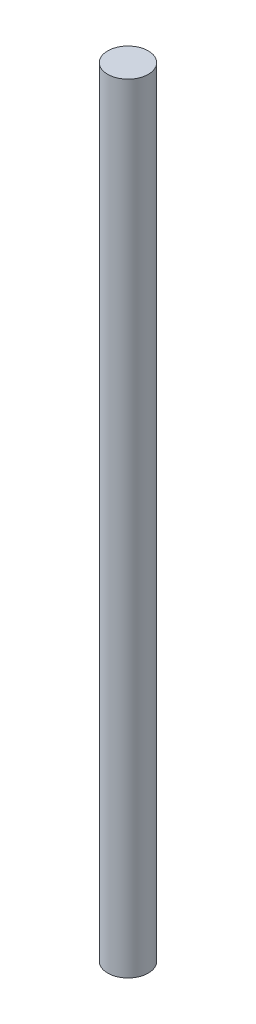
ISO-10303-21;
HEADER;
FILE_DESCRIPTION(('STEP AP214'),'2;1');
FILE_NAME('part.step','',(''),(''),'','','');
FILE_SCHEMA(('AUTOMOTIVE_DESIGN { 1 0 10303 214 1 1 1 1 }'));
ENDSEC;
DATA;
#1=APPLICATION_CONTEXT('core data for automotive mechanical design processes');
#2=APPLICATION_PROTOCOL_DEFINITION('international standard','automotive_design',2000,#1);
#3=PRODUCT_CONTEXT('',#1,'mechanical');
#4=PRODUCT('Part','Part','',(#3));
#5=PRODUCT_RELATED_PRODUCT_CATEGORY('part','',(#4));
#6=PRODUCT_DEFINITION_FORMATION('','',#4);
#7=PRODUCT_DEFINITION_CONTEXT('part definition',#1,'design');
#8=PRODUCT_DEFINITION('design','',#6,#7);
#9=PRODUCT_DEFINITION_SHAPE('','',#8);
#10=(LENGTH_UNIT() NAMED_UNIT(*) SI_UNIT(.MILLI.,.METRE.));
#11=(NAMED_UNIT(*) PLANE_ANGLE_UNIT() SI_UNIT($,.RADIAN.));
#12=(NAMED_UNIT(*) SI_UNIT($,.STERADIAN.) SOLID_ANGLE_UNIT());
#13=UNCERTAINTY_MEASURE_WITH_UNIT(LENGTH_MEASURE(1.E-05),#10,'distance_accuracy_value','');
#14=(GEOMETRIC_REPRESENTATION_CONTEXT(3) GLOBAL_UNCERTAINTY_ASSIGNED_CONTEXT((#13)) GLOBAL_UNIT_ASSIGNED_CONTEXT((#10,
#11,#12)) REPRESENTATION_CONTEXT('',''));
#15=CARTESIAN_POINT('',(0.,0.,0.));
#16=DIRECTION('',(0.,0.,1.));
#17=DIRECTION('',(1.,0.,0.));
#18=AXIS2_PLACEMENT_3D('',#15,#16,#17);
#19=CARTESIAN_POINT('',(0.,100.,0.));
#20=DIRECTION('',(0.,-1.,0.));
#21=DIRECTION('',(0.,0.,-1.));
#22=AXIS2_PLACEMENT_3D('',#19,#20,#21);
#23=CYLINDRICAL_SURFACE('',#22,2.60949965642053);
#24=CARTESIAN_POINT('',(0.,100.,0.));
#25=DIRECTION('',(0.,1.,0.));
#26=DIRECTION('',(0.,0.,1.));
#27=AXIS2_PLACEMENT_3D('',#24,#25,#26);
#28=CIRCLE('',#27,2.60949965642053);
#29=CARTESIAN_POINT('',(0.,100.,2.60949965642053));
#30=VERTEX_POINT('',#29);
#31=EDGE_CURVE('E10',#30,#30,#28,.T.);
#32=ORIENTED_EDGE('',*,*,#31,.F.);
#33=EDGE_LOOP('',(#32));
#34=FACE_BOUND('',#33,.T.);
#35=CARTESIAN_POINT('',(0.,0.,0.));
#36=DIRECTION('',(0.,1.,0.));
#37=DIRECTION('',(0.,0.,1.));
#38=AXIS2_PLACEMENT_3D('',#35,#36,#37);
#39=CIRCLE('',#38,2.60949965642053);
#40=CARTESIAN_POINT('',(0.,0.,2.60949965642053));
#41=VERTEX_POINT('',#40);
#42=EDGE_CURVE('E40',#41,#41,#39,.T.);
#43=ORIENTED_EDGE('',*,*,#42,.T.);
#44=EDGE_LOOP('',(#43));
#45=FACE_BOUND('',#44,.T.);
#46=ADVANCED_FACE('F37',(#34,#45),#23,.T.);
#47=CARTESIAN_POINT('',(0.,100.,0.));
#48=DIRECTION('',(0.,1.,0.));
#49=DIRECTION('',(0.,0.,1.));
#50=AXIS2_PLACEMENT_3D('',#47,#48,#49);
#51=PLANE('',#50);
#52=ORIENTED_EDGE('',*,*,#31,.T.);
#53=EDGE_LOOP('',(#52));
#54=FACE_BOUND('',#53,.T.);
#55=ADVANCED_FACE('F54',(#54),#51,.T.);
#56=CARTESIAN_POINT('',(0.,0.,0.));
#57=DIRECTION('',(0.,1.,0.));
#58=DIRECTION('',(0.,0.,1.));
#59=AXIS2_PLACEMENT_3D('',#56,#57,#58);
#60=PLANE('',#59);
#61=ORIENTED_EDGE('',*,*,#42,.F.);
#62=EDGE_LOOP('',(#61));
#63=FACE_BOUND('',#62,.T.);
#64=ADVANCED_FACE('F52',(#63),#60,.F.);
#65=CLOSED_SHELL('',(#46,#55,#64));
#66=MANIFOLD_SOLID_BREP('B2',#65);
#67=ADVANCED_BREP_SHAPE_REPRESENTATION('',(#18,#66),#14);
#68=SHAPE_DEFINITION_REPRESENTATION(#9,#67);
ENDSEC;
END-ISO-10303-21;
